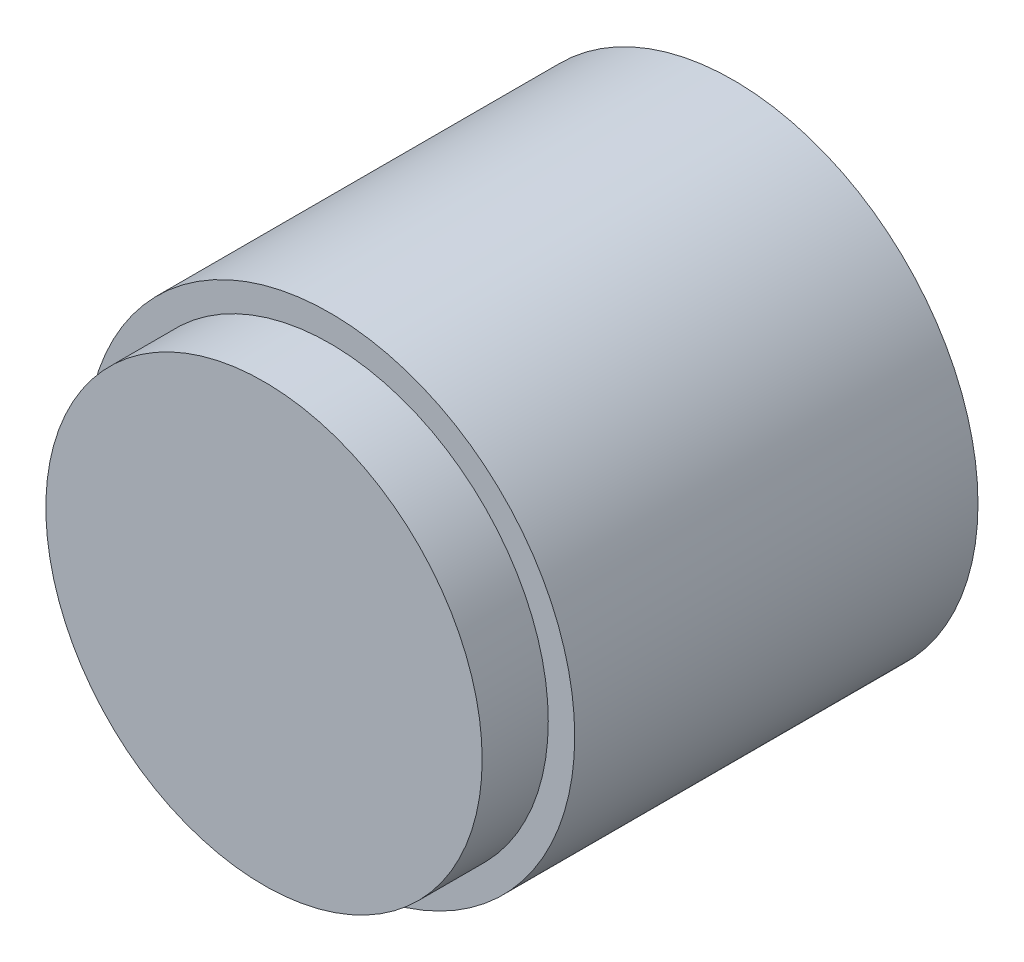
from build123d import *

# Parameters (mm, degrees)
SKIZZE1_R                       = 185
AUFSATZ_LINEAR_AUSTRAGEN1_DEPTH = 300
SKIZZE2_R                       = 45
SCHNITT_LINEAR_AUSTRAGEN1_DEPTH = 300
SCHNITT_LINEAR_START            = -295
SKIZZE3_R                       = 175
SKIZZE3_R_2                     = 45
SCHNITT_LINEAR_AUSTRAGEN2_DEPTH = 295
SKIZZE4_R                       = 185
AUFSATZ_LINEAR_AUSTRAGEN2_DEPTH = 5
SKIZZE6_R                       = 165
AUFSATZ_LINEAR_AUSTRAGEN3_DEPTH = 50


with BuildPart() as part:
    # Skizze1 → Aufsatz-Linear austragen1 (new body)
    with BuildSketch(Plane.XY):
        Circle(SKIZZE1_R)
    extrude(amount=AUFSATZ_LINEAR_AUSTRAGEN1_DEPTH)

    # Skizze2 → Schnitt-Linear austragen1 (cut)
    with BuildSketch(Plane(origin=(0, 0, 0), x_dir=(-1, 0, 0), z_dir=(0, 0, -1))):
        Circle(SKIZZE2_R)
    extrude(amount=-SCHNITT_LINEAR_AUSTRAGEN1_DEPTH, mode=Mode.SUBTRACT)

    # Skizze3 → Schnitt-Linear austragen2 (cut)
    with BuildSketch(Plane.XY.offset(300).offset(SCHNITT_LINEAR_START)):
        Circle(SKIZZE3_R)
        with Locations(Location((0, 0, 0), (0, 0, 180))):
            Circle(SKIZZE3_R_2, mode=Mode.SUBTRACT)
    extrude(amount=SCHNITT_LINEAR_AUSTRAGEN2_DEPTH, mode=Mode.SUBTRACT)

    # Skizze4 → Aufsatz-Linear austragen2 (add)
    with BuildSketch(Plane.XY.offset(300)):
        Circle(SKIZZE4_R)
    extrude(amount=AUFSATZ_LINEAR_AUSTRAGEN2_DEPTH)

    # Skizze6 → Aufsatz-Linear austragen3 (add)
    with BuildSketch(Plane.XY.offset(305)):
        Circle(SKIZZE6_R)
    extrude(amount=AUFSATZ_LINEAR_AUSTRAGEN3_DEPTH)


solid = part.part
